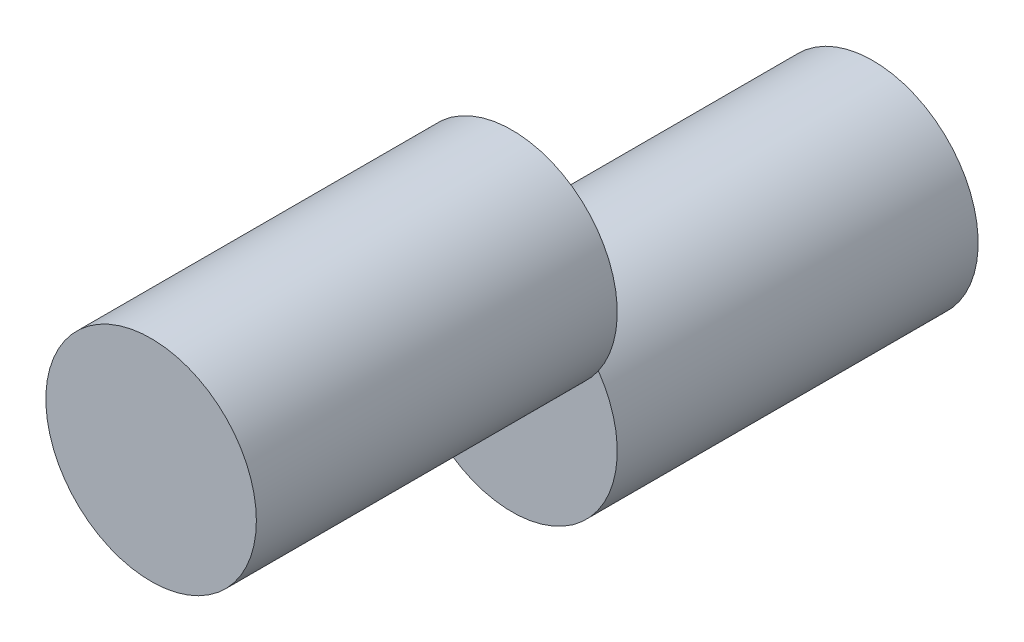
ISO-10303-21;
HEADER;
FILE_DESCRIPTION(('STEP AP214'),'2;1');
FILE_NAME('part.step','',(''),(''),'','','');
FILE_SCHEMA(('AUTOMOTIVE_DESIGN { 1 0 10303 214 1 1 1 1 }'));
ENDSEC;
DATA;
#1=APPLICATION_CONTEXT('core data for automotive mechanical design processes');
#2=APPLICATION_PROTOCOL_DEFINITION('international standard','automotive_design',2000,#1);
#3=PRODUCT_CONTEXT('',#1,'mechanical');
#4=PRODUCT('Part','Part','',(#3));
#5=PRODUCT_RELATED_PRODUCT_CATEGORY('part','',(#4));
#6=PRODUCT_DEFINITION_FORMATION('','',#4);
#7=PRODUCT_DEFINITION_CONTEXT('part definition',#1,'design');
#8=PRODUCT_DEFINITION('design','',#6,#7);
#9=PRODUCT_DEFINITION_SHAPE('','',#8);
#10=(LENGTH_UNIT() NAMED_UNIT(*) SI_UNIT(.MILLI.,.METRE.));
#11=(NAMED_UNIT(*) PLANE_ANGLE_UNIT() SI_UNIT($,.RADIAN.));
#12=(NAMED_UNIT(*) SI_UNIT($,.STERADIAN.) SOLID_ANGLE_UNIT());
#13=UNCERTAINTY_MEASURE_WITH_UNIT(LENGTH_MEASURE(1.E-05),#10,'distance_accuracy_value','');
#14=(GEOMETRIC_REPRESENTATION_CONTEXT(3) GLOBAL_UNCERTAINTY_ASSIGNED_CONTEXT((#13)) GLOBAL_UNIT_ASSIGNED_CONTEXT((#10,
#11,#12)) REPRESENTATION_CONTEXT('',''));
#15=CARTESIAN_POINT('',(0.,0.,0.));
#16=DIRECTION('',(0.,0.,1.));
#17=DIRECTION('',(1.,0.,0.));
#18=AXIS2_PLACEMENT_3D('',#15,#16,#17);
#19=CARTESIAN_POINT('',(0.,0.,152.4));
#20=DIRECTION('',(0.,0.,-1.));
#21=DIRECTION('',(-1.,0.,0.));
#22=AXIS2_PLACEMENT_3D('',#19,#20,#21);
#23=CYLINDRICAL_SURFACE('',#22,44.45);
#24=CARTESIAN_POINT('',(0.,0.,152.4));
#25=DIRECTION('',(0.,0.,1.));
#26=DIRECTION('',(1.,0.,0.));
#27=AXIS2_PLACEMENT_3D('',#24,#25,#26);
#28=CIRCLE('',#27,44.45);
#29=CARTESIAN_POINT('',(44.45,0.,152.4));
#30=VERTEX_POINT('',#29);
#31=EDGE_CURVE('E11',#30,#30,#28,.T.);
#32=ORIENTED_EDGE('',*,*,#31,.F.);
#33=EDGE_LOOP('',(#32));
#34=FACE_BOUND('',#33,.T.);
#35=CARTESIAN_POINT('',(0.,0.,0.));
#36=DIRECTION('',(0.,0.,1.));
#37=DIRECTION('',(1.,0.,0.));
#38=AXIS2_PLACEMENT_3D('',#35,#36,#37);
#39=CIRCLE('',#38,44.45);
#40=CARTESIAN_POINT('',(-36.4779728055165,-25.4,0.));
#41=VERTEX_POINT('',#40);
#42=CARTESIAN_POINT('',(36.4779728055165,-25.4,0.));
#43=VERTEX_POINT('',#42);
#44=EDGE_CURVE('E42',#41,#43,#39,.T.);
#45=ORIENTED_EDGE('',*,*,#44,.T.);
#46=EDGE_CURVE('E57',#43,#41,#39,.T.);
#47=ORIENTED_EDGE('',*,*,#46,.T.);
#48=EDGE_LOOP('',(#45,#47));
#49=FACE_BOUND('',#48,.T.);
#50=ADVANCED_FACE('F39',(#34,#49),#23,.T.);
#51=CARTESIAN_POINT('',(0.,0.,152.4));
#52=DIRECTION('',(0.,0.,1.));
#53=DIRECTION('',(1.,0.,0.));
#54=AXIS2_PLACEMENT_3D('',#51,#52,#53);
#55=PLANE('',#54);
#56=ORIENTED_EDGE('',*,*,#31,.T.);
#57=EDGE_LOOP('',(#56));
#58=FACE_BOUND('',#57,.T.);
#59=ADVANCED_FACE('F81',(#58),#55,.T.);
#60=CARTESIAN_POINT('',(0.,0.,0.));
#61=DIRECTION('',(0.,0.,1.));
#62=DIRECTION('',(1.,0.,0.));
#63=AXIS2_PLACEMENT_3D('',#60,#61,#62);
#64=PLANE('',#63);
#65=CARTESIAN_POINT('',(0.,-50.8,0.));
#66=DIRECTION('',(0.,0.,-1.));
#67=DIRECTION('',(-1.,0.,0.));
#68=AXIS2_PLACEMENT_3D('',#65,#66,#67);
#69=CIRCLE('',#68,44.45);
#70=EDGE_CURVE('E52',#41,#43,#69,.T.);
#71=ORIENTED_EDGE('',*,*,#70,.F.);
#72=ORIENTED_EDGE('',*,*,#46,.F.);
#73=EDGE_LOOP('',(#71,#72));
#74=FACE_BOUND('',#73,.T.);
#75=ADVANCED_FACE('F61',(#74),#64,.F.);
#76=CARTESIAN_POINT('',(0.,-50.8,-152.4));
#77=DIRECTION('',(0.,0.,1.));
#78=DIRECTION('',(1.,0.,0.));
#79=AXIS2_PLACEMENT_3D('',#76,#77,#78);
#80=CYLINDRICAL_SURFACE('',#79,44.45);
#81=CARTESIAN_POINT('',(0.,-50.8,-152.4));
#82=DIRECTION('',(0.,0.,-1.));
#83=DIRECTION('',(-1.,0.,0.));
#84=AXIS2_PLACEMENT_3D('',#81,#82,#83);
#85=CIRCLE('',#84,44.45);
#86=CARTESIAN_POINT('',(-44.45,-50.8,-152.4));
#87=VERTEX_POINT('',#86);
#88=EDGE_CURVE('E62',#87,#87,#85,.T.);
#89=ORIENTED_EDGE('',*,*,#88,.F.);
#90=EDGE_LOOP('',(#89));
#91=FACE_BOUND('',#90,.T.);
#92=ORIENTED_EDGE('',*,*,#70,.T.);
#93=EDGE_CURVE('E63',#43,#41,#69,.T.);
#94=ORIENTED_EDGE('',*,*,#93,.T.);
#95=EDGE_LOOP('',(#92,#94));
#96=FACE_BOUND('',#95,.T.);
#97=ADVANCED_FACE('F67',(#91,#96),#80,.T.);
#98=CARTESIAN_POINT('',(0.,-50.8,-152.4));
#99=DIRECTION('',(0.,0.,-1.));
#100=DIRECTION('',(-1.,0.,0.));
#101=AXIS2_PLACEMENT_3D('',#98,#99,#100);
#102=PLANE('',#101);
#103=ORIENTED_EDGE('',*,*,#88,.T.);
#104=EDGE_LOOP('',(#103));
#105=FACE_BOUND('',#104,.T.);
#106=ADVANCED_FACE('F72',(#105),#102,.T.);
#107=CARTESIAN_POINT('',(0.,-50.8,0.));
#108=DIRECTION('',(0.,0.,-1.));
#109=DIRECTION('',(-1.,0.,0.));
#110=AXIS2_PLACEMENT_3D('',#107,#108,#109);
#111=PLANE('',#110);
#112=ORIENTED_EDGE('',*,*,#44,.F.);
#113=ORIENTED_EDGE('',*,*,#93,.F.);
#114=EDGE_LOOP('',(#112,#113));
#115=FACE_BOUND('',#114,.T.);
#116=ADVANCED_FACE('F64',(#115),#111,.F.);
#117=CLOSED_SHELL('',(#50,#59,#75,#97,#106,#116));
#118=MANIFOLD_SOLID_BREP('B2',#117);
#119=ADVANCED_BREP_SHAPE_REPRESENTATION('',(#18,#118),#14);
#120=SHAPE_DEFINITION_REPRESENTATION(#9,#119);
ENDSEC;
END-ISO-10303-21;
